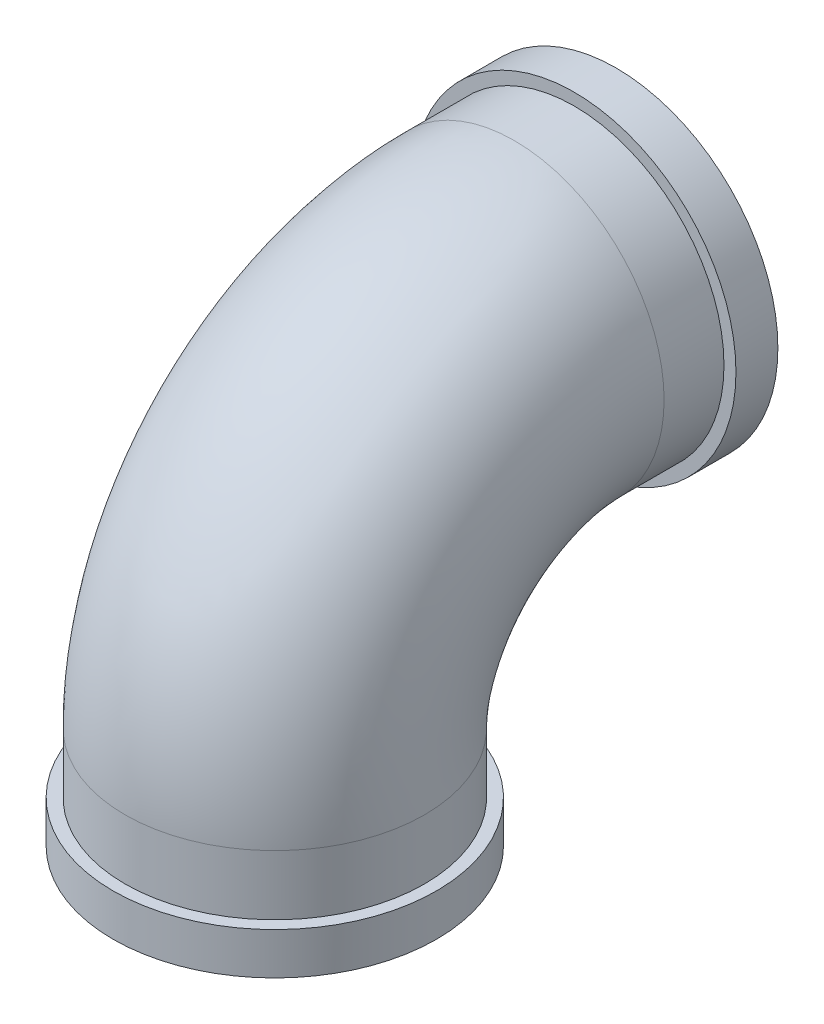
from build123d import *

# Parameters (mm, degrees)
SKETCH1_R           = 13.5
SKETCH1_R_2         = 8
BOSS_EXTRUDE1_DEPTH = 30
SKETCH4_R           = 13.5
SKETCH4_R_2         = 8
BOSS_EXTRUDE2_DEPTH = 30
SKETCH8_R           = 12.5
CUT_EXTRUDE1_START  = -26.5
SKETCH11_R          = 13.5
CUT_EXTRUDE1_DEPTH  = 26.5
CUT_EXTRUDE2_START  = -23
SKETCH12_R          = 13.5
CUT_EXTRUDE2_DEPTH  = 23
SKETCH13_R          = 13.5
SKETCH13_R_2        = 12.5
CUT_EXTRUDE3_DEPTH  = 3.5


with BuildPart() as part:
    # Sketch1 → Boss-Extrude1 (new body)
    with BuildSketch(Plane.XY):
        Circle(SKETCH1_R)
        Circle(SKETCH1_R_2, mode=Mode.SUBTRACT)
    extrude(amount=-BOSS_EXTRUDE1_DEPTH)


with BuildPart() as body_2:
    # Sketch4 → Boss-Extrude2 (new body)
    with BuildSketch(Plane(origin=(0, -25, 0), x_dir=(1, 0, 0), z_dir=(0, 1, 0))):
        with Locations(Location((0, -21.5, 0), (0, 0, 270))):
            Circle(SKETCH4_R)
        with Locations(Location((0, -21.5, 0), (0, 0, 270))):
            Circle(SKETCH4_R_2, mode=Mode.SUBTRACT)
    extrude(amount=-BOSS_EXTRUDE2_DEPTH)


with BuildPart() as body_3:
    # Sweep9: sweep along a path in Sketch6
    with BuildLine(Plane(origin=(0, 0, 0), x_dir=(0, 0, -1), z_dir=(1, 0, 0))) as sweep9_path:
        Line((30, 0), (0, 0))
        Line((0, 0), (-1.5, 0))
        ThreePointArc((-1.5, 0), (-15.642135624, -5.857864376), (-21.5, -20))
        Line((-21.5, -20), (-21.5, -25))
        Line((-21.5, -25), (-21.5, -55))
    # Sketch8 → Sweep9 (sweep)
    with BuildSketch(Plane.XY.offset(-30)):
        Circle(SKETCH8_R)
    sweep(path=sweep9_path.line)


with BuildPart() as part_1:
    add(part.part)

    # Combine1: union body 3, body 2
    add(body_3.part)
    add(body_2.part)

    # Sketch11 → Cut-Extrude1 (cut)
    with BuildSketch(Plane.XZ.offset(55).offset(CUT_EXTRUDE1_START)):
        with Locations(Location((0, 21.5, 0), (0, 0, 90))):
            Circle(SKETCH11_R)
    extrude(amount=CUT_EXTRUDE1_DEPTH, mode=Mode.SUBTRACT)

    # Sketch12 → Cut-Extrude2 (cut)
    with BuildSketch(Plane(origin=(0, 0, -30), x_dir=(-1, 0, 0), z_dir=(0, 0, -1)).offset(CUT_EXTRUDE2_START)):
        with Locations(Location((0, 0, 0), (0, 0, 180))):
            Circle(SKETCH12_R)
    extrude(amount=CUT_EXTRUDE2_DEPTH, mode=Mode.SUBTRACT)

    # Sketch13 → Cut-Extrude3 (cut)
    with BuildSketch(Plane.XY):
        Circle(SKETCH13_R)
        Circle(SKETCH13_R_2, mode=Mode.SUBTRACT)
    extrude(amount=-CUT_EXTRUDE3_DEPTH, mode=Mode.SUBTRACT)


solid = part_1.part
